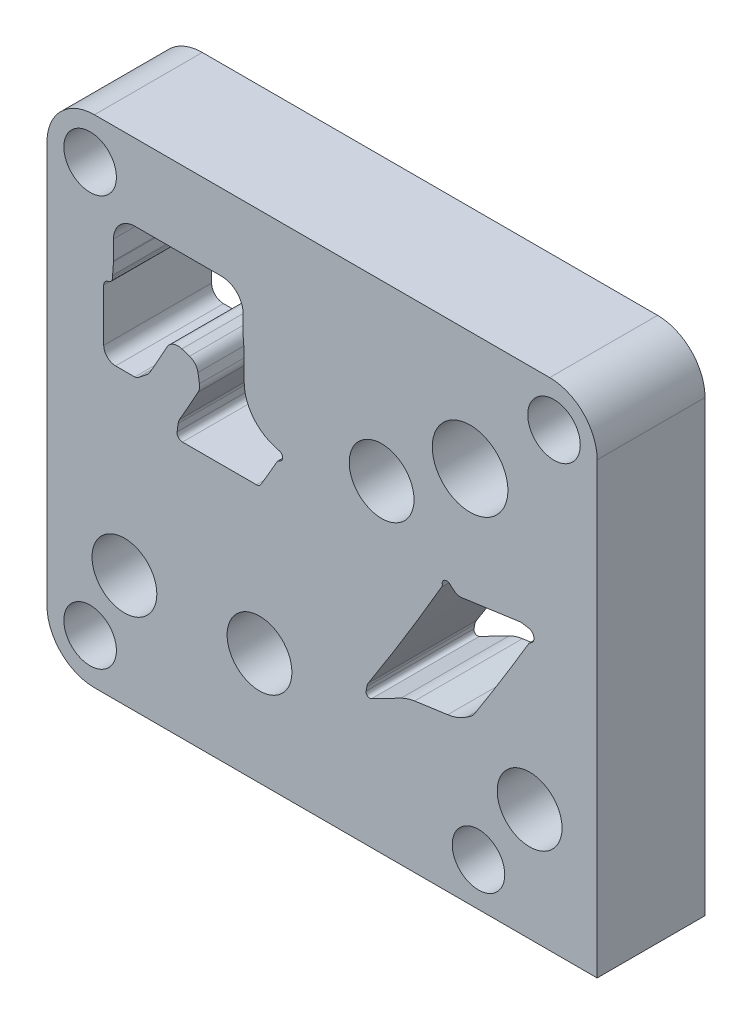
from build123d import *

# Parameters (mm, degrees)
BOSS_EXTRUDE1_DEPTH                                 = 31.75
HOLE1_D                                             = 19.0754
HOLE11_D                                            = 10.3124
HOLE11_CBORE_D                                      = 15.4686
HOLE11_CBORE_DEPTH                                  = 17.526
CUT_EXTRUDE1_QU250515L_PUNCH1_MOUNTED_IN_DEPTH      = 1036.664143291
CUT_EXTRUDE1_QU250515L_PUNCH1_MOUNTED_IN_DEPTH_BACK = 1036.664143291
CUT_EXTRUDE1_QU250515L_PUNCH4_MOUNTED_IN_DEPTH      = 1036.664143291
CUT_EXTRUDE1_QU250515L_PUNCH4_MOUNTED_IN_DEPTH_BACK = 1036.664143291
CUT_EXTRUDE1_DEPTH                                  = 1036.799186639
MOVE_FACE1_BY                                       = 1.5875


with BuildPart() as part:
    # Sketch1 → Boss-Extrude1 (new body)
    with BuildSketch(Plane.XY):
        with BuildLine():
            Line((-865.5685, -19.05), (-1013.5235, -19.05))
            ThreePointArc((-1013.5235, -19.05), (-1023.401781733, -14.958281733), (-1027.4935, -5.08))
            Line((-1027.4935, -5.08), (-1027.4935, 113.03))
            ThreePointArc((-1027.4935, 113.03), (-1023.401781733, 122.908281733), (-1013.5235, 127))
            Line((-1013.5235, 127), (-879.5385, 127))
            ThreePointArc((-879.5385, 127), (-869.660218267, 122.908281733), (-865.5685, 113.03))
            Line((-865.5685, 113.03), (-865.5685, -19.05))
        make_face()
    extrude(amount=-BOSS_EXTRUDE1_DEPTH)

    # Hole1 (through all)
    with Locations(Plane(origin=(-1008.351260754, 24.571140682, 0), x_dir=(1, 0, 0), z_dir=(0, 0, 1))):
        with Locations((3.654260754, -10.601140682), (43.405260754, -10.601140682), (122.907260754, -10.601140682), (79.346260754, 51.324059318), (105.381260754, 67.503859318)):
            Hole(HOLE1_D / 2)

    # Hole11 (through all)
    with Locations(Plane(origin=(-913.362607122, 0.934999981, 0), x_dir=(1, 0, 0), z_dir=(0, 0, 1))):
        with Locations((12.869107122, -7.284999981), (35.094107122, 113.365000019), (-101.430892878, 113.365000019), (-101.430892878, -7.284999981)):
            CounterBoreHole(HOLE11_D / 2, HOLE11_CBORE_D / 2, HOLE11_CBORE_DEPTH)

    # Sketch1 QU250515L_Punch1_Mounted in the → Cut-Extrude1 QU250515L_Punch1_Mounted in (cut, two sides: drawn at the far end of the back side and taken through both)
    with BuildSketch(Plane.XY.offset(-4.7625).offset(-CUT_EXTRUDE1_QU250515L_PUNCH1_MOUNTED_IN_DEPTH_BACK)):
        with BuildLine():
            Line((-933.335781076, 21.331990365), (-933.568061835, 20.073717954))
            ThreePointArc((-933.568061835, 20.073717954), (-933.148627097, 19.008228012), (-932.007273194, 18.916002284))
            Line((-932.007273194, 18.916002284), (-923.257211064, 23.437436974))
            ThreePointArc((-923.257211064, 23.437436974), (-921.330382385, 24.235363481), (-919.296953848, 24.698530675))
            Line((-919.296953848, 24.698530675), (-909.543594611, 26.069275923))
            ThreePointArc((-909.543594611, 26.069275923), (-906.599655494, 26.842287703), (-903.915629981, 28.27767329))
            Line((-903.915629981, 28.27767329), (-902.664955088, 29.148528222))
            ThreePointArc((-902.664955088, 29.148528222), (-902.163890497, 29.575877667), (-901.755563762, 30.092561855))
            ThreePointArc((-901.755563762, 30.092561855), (-893.616380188, 43.021731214), (-885.711814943, 56.095658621))
            ThreePointArc((-885.711814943, 56.095658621), (-885.491025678, 56.368159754), (-885.201069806, 56.565467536))
            ThreePointArc((-885.201069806, 56.565467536), (-884.178961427, 58.479258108), (-885.68515506, 60.040885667))
            Line((-885.68515506, 60.040885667), (-887.369848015, 60.337942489))
            ThreePointArc((-887.369848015, 60.337942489), (-887.915758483, 60.390507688), (-888.463170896, 60.357026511))
            Line((-888.463170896, 60.357026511), (-905.419428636, 57.973979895))
            ThreePointArc((-905.419428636, 57.973979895), (-906.596090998, 58.054622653), (-907.639750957, 58.60399635))
            Line((-907.639750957, 58.60399635), (-909.00808858, 59.739309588))
            ThreePointArc((-909.00808858, 59.739309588), (-910.490760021, 59.878051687), (-911.159227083, 58.547369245))
            ThreePointArc((-911.159227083, 58.547369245), (-911.171396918, 58.152976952), (-911.310422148, 57.783700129))
            ThreePointArc((-911.310422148, 57.783700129), (-921.870219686, 40.035231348), (-932.854126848, 22.54605608))
            ThreePointArc((-932.854126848, 22.54605608), (-933.154369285, 21.962594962), (-933.335781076, 21.331990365))
        make_face()
    extrude(amount=CUT_EXTRUDE1_QU250515L_PUNCH1_MOUNTED_IN_DEPTH + CUT_EXTRUDE1_QU250515L_PUNCH1_MOUNTED_IN_DEPTH_BACK, mode=Mode.SUBTRACT)

    # Sketch1 QU250515L_Punch4_Mounted in the → Cut-Extrude1 QU250515L_Punch4_Mounted in (cut, two sides: drawn at the far end of the back side and taken through both)
    with BuildSketch(Plane.XY.offset(-4.7625).offset(-CUT_EXTRUDE1_QU250515L_PUNCH4_MOUNTED_IN_DEPTH_BACK)):
        with BuildLine():
            Line((-959.0611264, 68.536774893), (-960.712192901, 69.044707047))
            ThreePointArc((-960.712192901, 69.044707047), (-967.030133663, 73.522189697), (-969.45196, 80.877390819))
            Line((-969.45196, 80.877390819), (-969.45196, 88.50380295))
            ThreePointArc((-969.45196, 88.50380295), (-969.45470198, 88.645894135), (-969.462923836, 88.787773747))
            Line((-969.462923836, 88.787773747), (-969.735636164, 92.314226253))
            ThreePointArc((-969.735636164, 92.314226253), (-969.74385802, 92.456105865), (-969.7466, 92.59819705))
            Line((-969.7466, 92.59819705), (-969.7466, 98.171))
            ThreePointArc((-969.7466, 98.171), (-971.613911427, 102.679088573), (-976.122, 104.5464))
            Line((-976.122, 104.5464), (-1001.522, 104.5464))
            ThreePointArc((-1001.522, 104.5464), (-1006.030088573, 102.679088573), (-1007.8974, 98.171))
            Line((-1007.8974, 98.171), (-1007.8974, 92.59819705))
            ThreePointArc((-1007.8974, 92.59819705), (-1007.90014198, 92.456105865), (-1007.908363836, 92.314226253))
            Line((-1007.908363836, 92.314226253), (-1008.181076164, 88.787773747))
            ThreePointArc((-1008.181076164, 88.787773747), (-1008.18929802, 88.645894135), (-1008.19204, 88.50380295))
            Line((-1008.19204, 88.50380295), (-1008.19204, 69.596))
            ThreePointArc((-1008.19204, 69.596), (-1007.168366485, 67.124633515), (-1004.697, 66.10096))
            Line((-1004.697, 66.10096), (-1001.662584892, 66.10096))
            ThreePointArc((-1001.662584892, 66.10096), (-1001.145382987, 66.18742779), (-1000.684432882, 66.437426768))
            Line((-1000.684432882, 66.437426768), (-998.058569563, 68.486364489))
            ThreePointArc((-998.058569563, 68.486364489), (-997.581465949, 68.940308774), (-997.201817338, 69.47841676))
            ThreePointArc((-997.201817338, 69.47841676), (-994.669792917, 73.968552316), (-992.165153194, 78.474020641))
            ThreePointArc((-992.165153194, 78.474020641), (-990.284323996, 80.1227353), (-987.784030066, 80.188376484))
            Line((-987.784030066, 80.188376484), (-985.527786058, 79.439444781))
            ThreePointArc((-985.527786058, 79.439444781), (-983.88835808, 78.336247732), (-983.055927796, 76.544090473))
            Line((-983.055927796, 76.544090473), (-982.620339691, 73.895668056))
            ThreePointArc((-982.620339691, 73.895668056), (-982.625625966, 72.669926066), (-983.033197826, 71.513917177))
            ThreePointArc((-983.033197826, 71.513917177), (-985.739410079, 66.670377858), (-988.476885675, 61.844439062))
            ThreePointArc((-988.476885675, 61.844439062), (-988.745438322, 61.245730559), (-988.892805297, 60.606312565))
            Line((-988.892805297, 60.606312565), (-989.188237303, 58.327925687))
            ThreePointArc((-989.188237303, 58.327925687), (-988.805829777, 57.073908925), (-987.611398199, 56.533421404))
            Line((-987.611398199, 56.533421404), (-965.862080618, 56.533421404))
            ThreePointArc((-965.862080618, 56.533421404), (-965.073613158, 56.74268399), (-964.492683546, 57.31539033))
            ThreePointArc((-964.492683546, 57.31539033), (-962.107384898, 61.383477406), (-959.744781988, 65.464787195))
            ThreePointArc((-959.744781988, 65.464787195), (-959.453378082, 65.804543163), (-959.058000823, 66.014369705))
            ThreePointArc((-959.058000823, 66.014369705), (-958.129230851, 67.276725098), (-959.0611264, 68.536774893))
        make_face()
    extrude(amount=CUT_EXTRUDE1_QU250515L_PUNCH4_MOUNTED_IN_DEPTH + CUT_EXTRUDE1_QU250515L_PUNCH4_MOUNTED_IN_DEPTH_BACK, mode=Mode.SUBTRACT)

    # Sketch2 → Cut-Extrude1 (cut, through all)
    with BuildSketch(Plane.XY):
        with BuildLine():
            Line((-1008.19204, 88.085675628), (-1008.19204, 69.596))
            ThreePointArc((-1008.19204, 69.596), (-1007.168366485, 67.124633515), (-1004.697, 66.10096))
            Line((-1004.697, 66.10096), (-1007.29796, 66.10096))
            ThreePointArc((-1007.29796, 66.10096), (-1009.769326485, 67.124633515), (-1010.793, 69.596))
            Line((-1010.793, 69.596), (-1010.793, 84.963))
            ThreePointArc((-1010.793, 84.963), (-1010.425295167, 85.979), (-1009.49252, 86.524337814))
            ThreePointArc((-1009.49252, 86.524337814), (-1008.559744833, 87.069675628), (-1008.19204, 88.085675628))
        make_face()
    extrude(amount=-CUT_EXTRUDE1_DEPTH, mode=Mode.SUBTRACT)

    # Move Face1: a curved face moved inward by 1.5875
    add(Solid.thicken(part.faces().sort_by_distance((-893.4323, 92.075, -15.875))[0], -MOVE_FACE1_BY), mode=Mode.SUBTRACT)


solid = part.part
